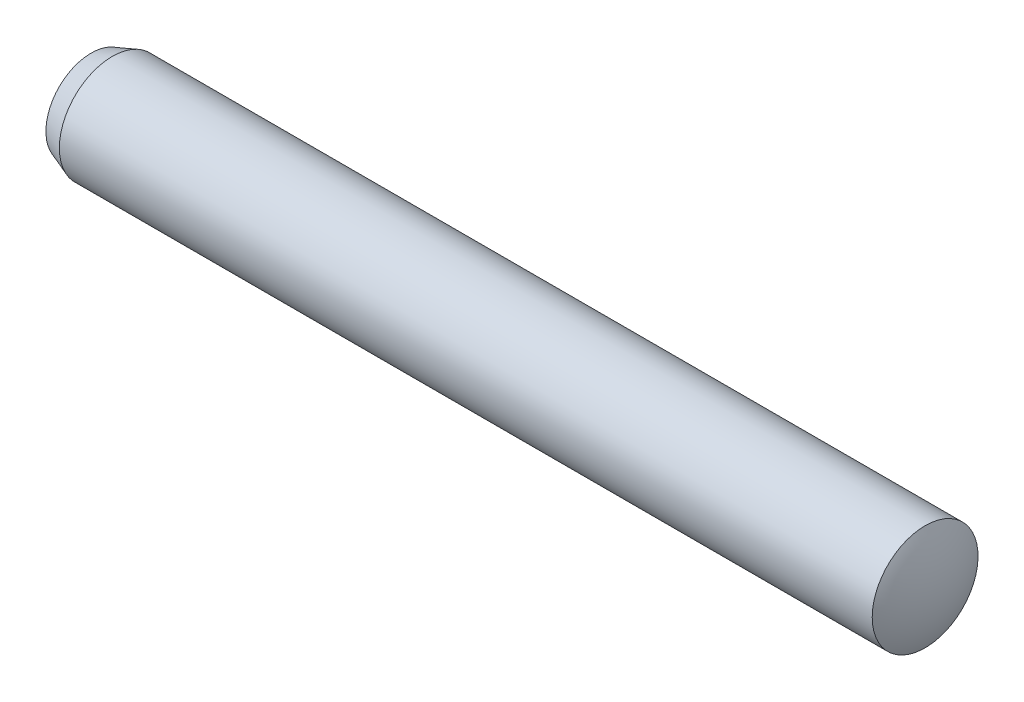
from build123d import *


with BuildPart() as part:
    # Esquisse1 → Base-R_volution (revolve)
    with BuildSketch(Plane.XY):
        with BuildLine():
            Line((0, 0), (0, 4.272059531))
            Line((0, 4.272059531), (2, 5))
            Line((2, 5), (78.8, 5))
            ThreePointArc((78.8, 5), (79.69580011, 2.570992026), (80, 0))
            Line((80, 0), (0, 0))
        make_face()
    revolve(axis=Axis((0, 0, 0), (1, 0, 0)))


solid = part.part
